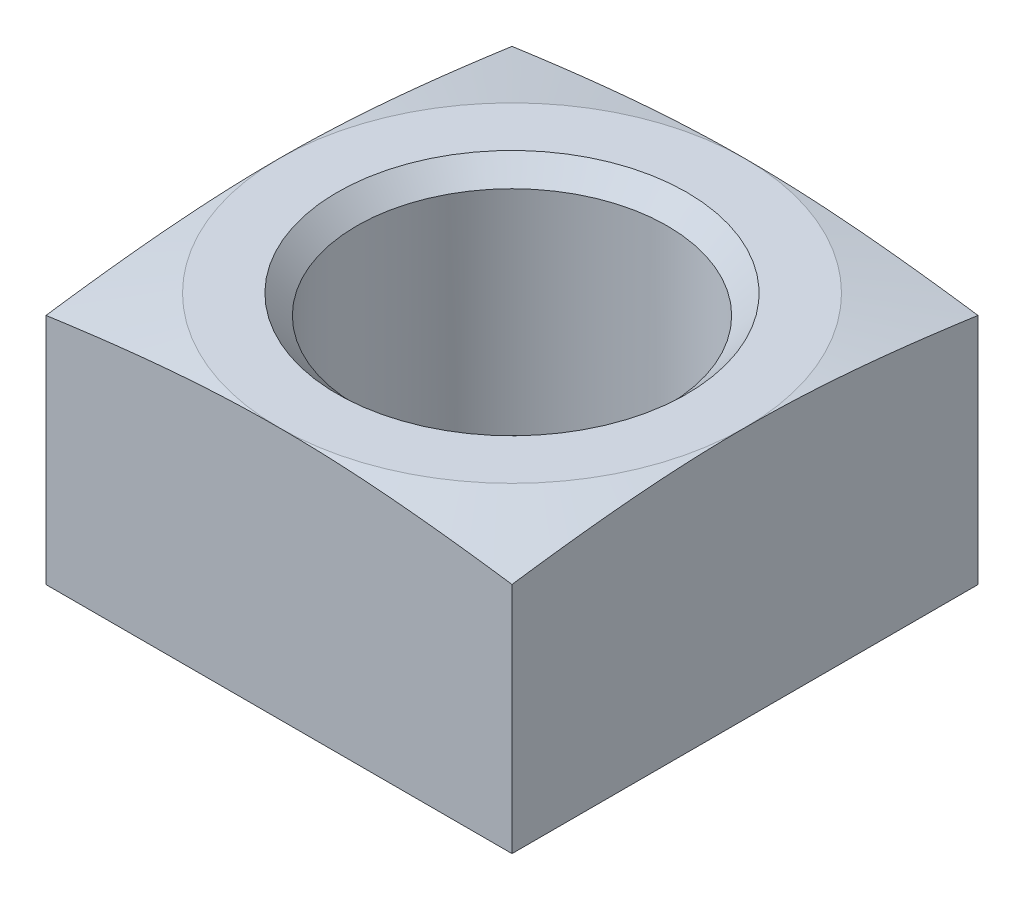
ISO-10303-21;
HEADER;
FILE_DESCRIPTION(('STEP AP214'),'2;1');
FILE_NAME('part.step','',(''),(''),'','','');
FILE_SCHEMA(('AUTOMOTIVE_DESIGN { 1 0 10303 214 1 1 1 1 }'));
ENDSEC;
DATA;
#1=APPLICATION_CONTEXT('core data for automotive mechanical design processes');
#2=APPLICATION_PROTOCOL_DEFINITION('international standard','automotive_design',2000,#1);
#3=PRODUCT_CONTEXT('',#1,'mechanical');
#4=PRODUCT('Part','Part','',(#3));
#5=PRODUCT_RELATED_PRODUCT_CATEGORY('part','',(#4));
#6=PRODUCT_DEFINITION_FORMATION('','',#4);
#7=PRODUCT_DEFINITION_CONTEXT('part definition',#1,'design');
#8=PRODUCT_DEFINITION('design','',#6,#7);
#9=PRODUCT_DEFINITION_SHAPE('','',#8);
#10=(LENGTH_UNIT() NAMED_UNIT(*) SI_UNIT(.MILLI.,.METRE.));
#11=(NAMED_UNIT(*) PLANE_ANGLE_UNIT() SI_UNIT($,.RADIAN.));
#12=(NAMED_UNIT(*) SI_UNIT($,.STERADIAN.) SOLID_ANGLE_UNIT());
#13=UNCERTAINTY_MEASURE_WITH_UNIT(LENGTH_MEASURE(1.E-05),#10,'distance_accuracy_value','');
#14=(GEOMETRIC_REPRESENTATION_CONTEXT(3) GLOBAL_UNCERTAINTY_ASSIGNED_CONTEXT((#13)) GLOBAL_UNIT_ASSIGNED_CONTEXT((#10,
#11,#12)) REPRESENTATION_CONTEXT('',''));
#15=CARTESIAN_POINT('',(0.,0.,0.));
#16=DIRECTION('',(0.,0.,1.));
#17=DIRECTION('',(1.,0.,0.));
#18=AXIS2_PLACEMENT_3D('',#15,#16,#17);
#19=CARTESIAN_POINT('',(12.,6.5,12.));
#20=DIRECTION('',(0.,0.,-1.));
#21=DIRECTION('',(-1.,0.,0.));
#22=AXIS2_PLACEMENT_3D('',#19,#20,#21);
#23=PLANE('',#22);
#24=DIRECTION('',(0.,-1.,0.));
#25=VECTOR('',#24,1.);
#26=CARTESIAN_POINT('',(12.,6.5,12.));
#27=LINE('',#26,#25);
#28=CARTESIAN_POINT('',(12.,5.50588745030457,12.));
#29=VERTEX_POINT('',#28);
#30=CARTESIAN_POINT('',(12.,-6.5,12.));
#31=VERTEX_POINT('',#30);
#32=EDGE_CURVE('E122',#29,#31,#27,.T.);
#33=ORIENTED_EDGE('',*,*,#32,.F.);
#34=CARTESIAN_POINT('',(-23.953590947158,3.54173714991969,12.));
#35=CARTESIAN_POINT('',(-23.3312218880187,3.65300849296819,12.));
#36=CARTESIAN_POINT('',(-22.7087066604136,3.76347087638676,12.));
#37=CARTESIAN_POINT('',(-21.4633093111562,3.98234194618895,12.));
#38=CARTESIAN_POINT('',(-20.8404271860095,4.09075061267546,12.));
#39=CARTESIAN_POINT('',(-19.594285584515,4.30506734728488,12.));
#40=CARTESIAN_POINT('',(-18.9710261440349,4.41097562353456,12.));
#41=CARTESIAN_POINT('',(-17.7239904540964,4.61970457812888,12.));
#42=CARTESIAN_POINT('',(-17.100214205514,4.72252526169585,12.));
#43=CARTESIAN_POINT('',(-15.8538299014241,4.92402388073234,12.));
#44=CARTESIAN_POINT('',(-15.2312236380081,5.0227128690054,12.));
#45=CARTESIAN_POINT('',(-13.9852621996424,5.21526876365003,12.));
#46=CARTESIAN_POINT('',(-13.3619070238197,5.30913566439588,12.));
#47=CARTESIAN_POINT('',(-12.1141151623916,5.49078517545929,12.));
#48=CARTESIAN_POINT('',(-11.4896782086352,5.57856595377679,12.));
#49=CARTESIAN_POINT('',(-10.2397502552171,5.74634930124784,12.));
#50=CARTESIAN_POINT('',(-9.61425925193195,5.82635184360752,12.));
#51=CARTESIAN_POINT('',(-8.35783107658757,5.97699569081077,12.));
#52=CARTESIAN_POINT('',(-7.72688575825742,6.04756975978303,12.));
#53=CARTESIAN_POINT('',(-6.46369871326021,6.17614944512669,12.));
#54=CARTESIAN_POINT('',(-5.83145698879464,6.23415508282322,12.));
#55=CARTESIAN_POINT('',(-4.56614823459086,6.33474486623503,12.));
#56=CARTESIAN_POINT('',(-3.93308203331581,6.37733924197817,12.));
#57=CARTESIAN_POINT('',(-2.66598623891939,6.44451772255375,12.));
#58=CARTESIAN_POINT('',(-2.03195666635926,6.46910220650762,12.));
#59=CARTESIAN_POINT('',(-0.762031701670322,6.49848071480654,12.));
#60=CARTESIAN_POINT('',(-0.126135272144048,6.50323110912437,12.));
#61=CARTESIAN_POINT('',(1.14548168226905,6.4924413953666,12.));
#62=CARTESIAN_POINT('',(1.78120220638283,6.47690119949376,12.));
#63=CARTESIAN_POINT('',(3.05226428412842,6.42672300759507,12.));
#64=CARTESIAN_POINT('',(3.68760537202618,6.39207340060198,12.));
#65=CARTESIAN_POINT('',(4.63973585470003,6.32754841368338,12.));
#66=CARTESIAN_POINT('',(4.95696877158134,6.30394804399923,12.));
#67=CARTESIAN_POINT('',(5.59112625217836,6.25291431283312,12.));
#68=CARTESIAN_POINT('',(5.90805081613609,6.22548095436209,12.));
#69=CARTESIAN_POINT('',(7.12743714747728,6.11319192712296,12.));
#70=CARTESIAN_POINT('',(8.02876829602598,6.01597313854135,12.));
#71=CARTESIAN_POINT('',(9.82900087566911,5.8010512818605,12.));
#72=CARTESIAN_POINT('',(10.7279020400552,5.68334605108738,12.));
#73=CARTESIAN_POINT('',(12.5239827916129,5.43339082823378,12.));
#74=CARTESIAN_POINT('',(13.4211616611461,5.30113572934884,12.));
#75=CARTESIAN_POINT('',(15.2138906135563,5.02633800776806,12.));
#76=CARTESIAN_POINT('',(16.1094407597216,4.88379579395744,12.));
#77=CARTESIAN_POINT('',(17.9004767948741,4.59112284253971,12.));
#78=CARTESIAN_POINT('',(18.7959611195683,4.4409825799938,12.));
#79=CARTESIAN_POINT('',(20.5860048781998,4.13526710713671,12.));
#80=CARTESIAN_POINT('',(21.4805643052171,3.97969185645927,12.));
#81=CARTESIAN_POINT('',(23.2687784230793,3.66451437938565,12.));
#82=CARTESIAN_POINT('',(24.1624332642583,3.50491300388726,12.));
#83=CARTESIAN_POINT('',(25.9491817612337,3.18261839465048,12.));
#84=CARTESIAN_POINT('',(26.8422754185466,3.01992516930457,12.));
#85=CARTESIAN_POINT('',(28.6247643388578,2.69273848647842,12.));
#86=CARTESIAN_POINT('',(29.5141612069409,2.52825376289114,12.));
#87=CARTESIAN_POINT('',(31.2926047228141,2.19740069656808,12.));
#88=CARTESIAN_POINT('',(32.1816513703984,2.03103235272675,12.));
#89=CARTESIAN_POINT('',(34.8484835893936,1.52966341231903,12.));
#90=CARTESIAN_POINT('',(36.6258473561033,1.19241995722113,12.));
#91=CARTESIAN_POINT('',(40.1749325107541,0.514898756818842,12.));
#92=CARTESIAN_POINT('',(41.9466559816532,0.174631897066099,12.));
#93=CARTESIAN_POINT('',(44.6037760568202,-0.337840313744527,12.));
#94=CARTESIAN_POINT('',(45.4893738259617,-0.50900359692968,12.));
#95=CARTESIAN_POINT('',(47.2604536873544,-0.851925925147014,12.));
#96=CARTESIAN_POINT('',(48.1459357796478,-1.02368496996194,12.));
#97=CARTESIAN_POINT('',(49.0313695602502,-1.1956925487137,12.));
#98=B_SPLINE_CURVE_WITH_KNOTS('',3,(#34,#35,#36,#37,#38,#39,#40,#41,#42,#43,#44,#45,#46,#47,#48,
#49,#50,#51,#52,#53,#54,#55,#56,#57,#58,#59,#60,#61,#62,#63,#64,#65,#66,#67,#68,#69,#70,#71,#72,
#73,#74,#75,#76,#77,#78,#79,#80,#81,#82,#83,#84,#85,#86,#87,#88,#89,#90,#91,#92,#93,#94,#95,#96,
#97),.UNSPECIFIED.,.F.,.F.,(4,2,2,2,2,2,2,2,2,2,2,2,2,2,2,2,2,2,2,2,2,2,2,2,2,2,2,2,2,2,2,4),
(0.,1.89671494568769,3.79344825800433,5.69002312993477,7.58659479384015,9.47771793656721,
11.3688432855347,13.2605354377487,15.1522341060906,17.0567746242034,18.961311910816,
20.8645826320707,22.7678132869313,24.6752283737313,26.5826517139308,28.4912352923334,
29.4455448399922,30.3998536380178,33.1191461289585,35.8387258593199,38.5592631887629,
41.2796924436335,44.0036208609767,46.7275695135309,49.4509472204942,52.1743175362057,
54.8877515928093,57.6011872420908,63.028406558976,68.4407111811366,71.1466715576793,
73.8526309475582),.UNSPECIFIED.);
#99=CARTESIAN_POINT('',(0.,6.5,12.));
#100=VERTEX_POINT('',#99);
#101=EDGE_CURVE('E99',#29,#100,#98,.F.);
#102=ORIENTED_EDGE('',*,*,#101,.T.);
#103=CARTESIAN_POINT('',(-12.,5.50588745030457,12.));
#104=VERTEX_POINT('',#103);
#105=EDGE_CURVE('E112',#100,#104,#98,.F.);
#106=ORIENTED_EDGE('',*,*,#105,.T.);
#107=DIRECTION('',(0.,-1.,0.));
#108=VECTOR('',#107,1.);
#109=CARTESIAN_POINT('',(-12.,6.5,12.));
#110=LINE('',#109,#108);
#111=CARTESIAN_POINT('',(-12.,-6.5,12.));
#112=VERTEX_POINT('',#111);
#113=EDGE_CURVE('E184',#104,#112,#110,.T.);
#114=ORIENTED_EDGE('',*,*,#113,.T.);
#115=DIRECTION('',(-1.,0.,0.));
#116=VECTOR('',#115,1.);
#117=CARTESIAN_POINT('',(12.,-6.5,12.));
#118=LINE('',#117,#116);
#119=EDGE_CURVE('E194',#31,#112,#118,.T.);
#120=ORIENTED_EDGE('',*,*,#119,.F.);
#121=EDGE_LOOP('',(#33,#102,#106,#114,#120));
#122=FACE_BOUND('',#121,.T.);
#123=ADVANCED_FACE('F39',(#122),#23,.F.);
#124=CARTESIAN_POINT('',(12.,-6.5,-12.));
#125=DIRECTION('',(0.,1.,0.));
#126=DIRECTION('',(0.,0.,1.));
#127=AXIS2_PLACEMENT_3D('',#124,#125,#126);
#128=PLANE('',#127);
#129=CARTESIAN_POINT('',(0.,-6.5,0.));
#130=DIRECTION('',(0.,1.,0.));
#131=DIRECTION('',(0.,0.,1.));
#132=AXIS2_PLACEMENT_3D('',#129,#130,#131);
#133=CIRCLE('',#132,9.00000000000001);
#134=CARTESIAN_POINT('',(0.,-6.5,9.));
#135=VERTEX_POINT('',#134);
#136=EDGE_CURVE('E11',#135,#135,#133,.T.);
#137=ORIENTED_EDGE('',*,*,#136,.T.);
#138=EDGE_LOOP('',(#137));
#139=FACE_BOUND('',#138,.T.);
#140=DIRECTION('',(0.,0.,-1.));
#141=VECTOR('',#140,1.);
#142=CARTESIAN_POINT('',(-12.,-6.5,-12.));
#143=LINE('',#142,#141);
#144=CARTESIAN_POINT('',(-12.,-6.5,-12.));
#145=VERTEX_POINT('',#144);
#146=EDGE_CURVE('E187',#112,#145,#143,.T.);
#147=ORIENTED_EDGE('',*,*,#146,.T.);
#148=DIRECTION('',(-1.,0.,0.));
#149=VECTOR('',#148,1.);
#150=CARTESIAN_POINT('',(12.,-6.5,-12.));
#151=LINE('',#150,#149);
#152=CARTESIAN_POINT('',(12.,-6.5,-12.));
#153=VERTEX_POINT('',#152);
#154=EDGE_CURVE('E183',#153,#145,#151,.T.);
#155=ORIENTED_EDGE('',*,*,#154,.F.);
#156=DIRECTION('',(0.,0.,-1.));
#157=VECTOR('',#156,1.);
#158=CARTESIAN_POINT('',(12.,-6.5,-12.));
#159=LINE('',#158,#157);
#160=EDGE_CURVE('E175',#31,#153,#159,.T.);
#161=ORIENTED_EDGE('',*,*,#160,.F.);
#162=ORIENTED_EDGE('',*,*,#119,.T.);
#163=EDGE_LOOP('',(#147,#155,#161,#162));
#164=FACE_BOUND('',#163,.T.);
#165=ADVANCED_FACE('F226',(#139,#164),#128,.F.);
#166=CARTESIAN_POINT('',(12.,6.5,-12.));
#167=DIRECTION('',(0.,0.,1.));
#168=DIRECTION('',(0.,-1.,0.));
#169=AXIS2_PLACEMENT_3D('',#166,#167,#168);
#170=PLANE('',#169);
#171=DIRECTION('',(0.,1.,0.));
#172=VECTOR('',#171,1.);
#173=CARTESIAN_POINT('',(-12.,6.5,-12.));
#174=LINE('',#173,#172);
#175=CARTESIAN_POINT('',(-12.,5.50588745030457,-12.));
#176=VERTEX_POINT('',#175);
#177=EDGE_CURVE('E176',#145,#176,#174,.T.);
#178=ORIENTED_EDGE('',*,*,#177,.T.);
#179=CARTESIAN_POINT('',(-23.953590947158,3.54173714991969,-12.));
#180=CARTESIAN_POINT('',(-23.3312218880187,3.65300849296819,-12.));
#181=CARTESIAN_POINT('',(-22.7087066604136,3.76347087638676,-12.));
#182=CARTESIAN_POINT('',(-21.4633093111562,3.98234194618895,-12.));
#183=CARTESIAN_POINT('',(-20.8404271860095,4.09075061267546,-12.));
#184=CARTESIAN_POINT('',(-19.594285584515,4.30506734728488,-12.));
#185=CARTESIAN_POINT('',(-18.9710261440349,4.41097562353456,-12.));
#186=CARTESIAN_POINT('',(-17.7239904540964,4.61970457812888,-12.));
#187=CARTESIAN_POINT('',(-17.100214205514,4.72252526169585,-12.));
#188=CARTESIAN_POINT('',(-15.8538299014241,4.92402388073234,-12.));
#189=CARTESIAN_POINT('',(-15.2312236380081,5.0227128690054,-12.));
#190=CARTESIAN_POINT('',(-13.9852621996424,5.21526876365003,-12.));
#191=CARTESIAN_POINT('',(-13.3619070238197,5.30913566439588,-12.));
#192=CARTESIAN_POINT('',(-12.1141151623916,5.49078517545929,-12.));
#193=CARTESIAN_POINT('',(-11.4896782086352,5.57856595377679,-12.));
#194=CARTESIAN_POINT('',(-10.2397502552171,5.74634930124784,-12.));
#195=CARTESIAN_POINT('',(-9.61425925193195,5.82635184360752,-12.));
#196=CARTESIAN_POINT('',(-8.35783107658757,5.97699569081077,-12.));
#197=CARTESIAN_POINT('',(-7.72688575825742,6.04756975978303,-12.));
#198=CARTESIAN_POINT('',(-6.46369871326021,6.17614944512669,-12.));
#199=CARTESIAN_POINT('',(-5.83145698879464,6.23415508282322,-12.));
#200=CARTESIAN_POINT('',(-4.56614823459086,6.33474486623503,-12.));
#201=CARTESIAN_POINT('',(-3.93308203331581,6.37733924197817,-12.));
#202=CARTESIAN_POINT('',(-2.66598623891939,6.44451772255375,-12.));
#203=CARTESIAN_POINT('',(-2.03195666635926,6.46910220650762,-12.));
#204=CARTESIAN_POINT('',(-0.762031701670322,6.49848071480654,-12.));
#205=CARTESIAN_POINT('',(-0.126135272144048,6.50323110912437,-12.));
#206=CARTESIAN_POINT('',(1.14548168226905,6.4924413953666,-12.));
#207=CARTESIAN_POINT('',(1.78120220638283,6.47690119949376,-12.));
#208=CARTESIAN_POINT('',(3.05226428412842,6.42672300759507,-12.));
#209=CARTESIAN_POINT('',(3.68760537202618,6.39207340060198,-12.));
#210=CARTESIAN_POINT('',(4.63973585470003,6.32754841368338,-12.));
#211=CARTESIAN_POINT('',(4.95696877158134,6.30394804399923,-12.));
#212=CARTESIAN_POINT('',(5.59112625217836,6.25291431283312,-12.));
#213=CARTESIAN_POINT('',(5.90805081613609,6.22548095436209,-12.));
#214=CARTESIAN_POINT('',(7.12743714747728,6.11319192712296,-12.));
#215=CARTESIAN_POINT('',(8.02876829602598,6.01597313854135,-12.));
#216=CARTESIAN_POINT('',(9.82900087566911,5.8010512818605,-12.));
#217=CARTESIAN_POINT('',(10.7279020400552,5.68334605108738,-12.));
#218=CARTESIAN_POINT('',(12.5239827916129,5.43339082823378,-12.));
#219=CARTESIAN_POINT('',(13.4211616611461,5.30113572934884,-12.));
#220=CARTESIAN_POINT('',(15.2138906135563,5.02633800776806,-12.));
#221=CARTESIAN_POINT('',(16.1094407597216,4.88379579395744,-12.));
#222=CARTESIAN_POINT('',(17.9004767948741,4.59112284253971,-12.));
#223=CARTESIAN_POINT('',(18.7959611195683,4.4409825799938,-12.));
#224=CARTESIAN_POINT('',(20.5860048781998,4.13526710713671,-12.));
#225=CARTESIAN_POINT('',(21.4805643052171,3.97969185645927,-12.));
#226=CARTESIAN_POINT('',(23.2687784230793,3.66451437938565,-12.));
#227=CARTESIAN_POINT('',(24.1624332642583,3.50491300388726,-12.));
#228=CARTESIAN_POINT('',(25.9491817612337,3.18261839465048,-12.));
#229=CARTESIAN_POINT('',(26.8422754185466,3.01992516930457,-12.));
#230=CARTESIAN_POINT('',(28.6247643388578,2.69273848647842,-12.));
#231=CARTESIAN_POINT('',(29.5141612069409,2.52825376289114,-12.));
#232=CARTESIAN_POINT('',(31.2926047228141,2.19740069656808,-12.));
#233=CARTESIAN_POINT('',(32.1816513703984,2.03103235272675,-12.));
#234=CARTESIAN_POINT('',(34.8484835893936,1.52966341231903,-12.));
#235=CARTESIAN_POINT('',(36.6258473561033,1.19241995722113,-12.));
#236=CARTESIAN_POINT('',(40.1749325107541,0.514898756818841,-12.));
#237=CARTESIAN_POINT('',(41.9466559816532,0.174631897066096,-12.));
#238=CARTESIAN_POINT('',(44.6037760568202,-0.337840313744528,-12.));
#239=CARTESIAN_POINT('',(45.4893738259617,-0.509003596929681,-12.));
#240=CARTESIAN_POINT('',(47.2604536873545,-0.851925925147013,-12.));
#241=CARTESIAN_POINT('',(48.1459357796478,-1.02368496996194,-12.));
#242=CARTESIAN_POINT('',(49.0313695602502,-1.1956925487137,-12.));
#243=B_SPLINE_CURVE_WITH_KNOTS('',3,(#179,#180,#181,#182,#183,#184,#185,#186,#187,#188,#189,
#190,#191,#192,#193,#194,#195,#196,#197,#198,#199,#200,#201,#202,#203,#204,#205,#206,#207,#208,
#209,#210,#211,#212,#213,#214,#215,#216,#217,#218,#219,#220,#221,#222,#223,#224,#225,#226,#227,
#228,#229,#230,#231,#232,#233,#234,#235,#236,#237,#238,#239,#240,#241,#242),.UNSPECIFIED.,.F.,
.F.,(4,2,2,2,2,2,2,2,2,2,2,2,2,2,2,2,2,2,2,2,2,2,2,2,2,2,2,2,2,2,2,4),(0.,1.89671494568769,
3.79344825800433,5.69002312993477,7.58659479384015,9.47771793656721,11.3688432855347,
13.2605354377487,15.1522341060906,17.0567746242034,18.961311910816,20.8645826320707,
22.7678132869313,24.6752283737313,26.5826517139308,28.4912352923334,29.4455448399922,
30.3998536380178,33.1191461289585,35.8387258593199,38.5592631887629,41.2796924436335,
44.0036208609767,46.7275695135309,49.4509472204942,52.1743175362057,54.8877515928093,
57.6011872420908,63.028406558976,68.4407111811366,71.1466715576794,73.8526309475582),.UNSPECIFIED.);
#244=CARTESIAN_POINT('',(0.,6.5,-12.));
#245=VERTEX_POINT('',#244);
#246=EDGE_CURVE('E62',#176,#245,#243,.T.);
#247=ORIENTED_EDGE('',*,*,#246,.T.);
#248=CARTESIAN_POINT('',(12.,5.50588745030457,-12.));
#249=VERTEX_POINT('',#248);
#250=EDGE_CURVE('E138',#245,#249,#243,.T.);
#251=ORIENTED_EDGE('',*,*,#250,.T.);
#252=DIRECTION('',(0.,1.,0.));
#253=VECTOR('',#252,1.);
#254=CARTESIAN_POINT('',(12.,6.5,-12.));
#255=LINE('',#254,#253);
#256=EDGE_CURVE('E179',#153,#249,#255,.T.);
#257=ORIENTED_EDGE('',*,*,#256,.F.);
#258=ORIENTED_EDGE('',*,*,#154,.T.);
#259=EDGE_LOOP('',(#178,#247,#251,#257,#258));
#260=FACE_BOUND('',#259,.T.);
#261=ADVANCED_FACE('F144',(#260),#170,.F.);
#262=CARTESIAN_POINT('',(12.,0.,0.));
#263=DIRECTION('',(-1.,0.,0.));
#264=DIRECTION('',(0.,0.,1.));
#265=AXIS2_PLACEMENT_3D('',#262,#263,#264);
#266=PLANE('',#265);
#267=ORIENTED_EDGE('',*,*,#256,.T.);
#268=CARTESIAN_POINT('',(12.,3.54173714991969,-23.953590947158));
#269=CARTESIAN_POINT('',(12.,3.65300849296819,-23.3312218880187));
#270=CARTESIAN_POINT('',(12.,3.76347087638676,-22.7087066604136));
#271=CARTESIAN_POINT('',(12.,3.98234194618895,-21.4633093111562));
#272=CARTESIAN_POINT('',(12.,4.09075061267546,-20.8404271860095));
#273=CARTESIAN_POINT('',(12.,4.30506734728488,-19.594285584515));
#274=CARTESIAN_POINT('',(12.,4.41097562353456,-18.9710261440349));
#275=CARTESIAN_POINT('',(12.,4.61970457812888,-17.7239904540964));
#276=CARTESIAN_POINT('',(12.,4.72252526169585,-17.100214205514));
#277=CARTESIAN_POINT('',(12.,4.92402388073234,-15.8538299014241));
#278=CARTESIAN_POINT('',(12.,5.0227128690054,-15.2312236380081));
#279=CARTESIAN_POINT('',(12.,5.21526876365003,-13.9852621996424));
#280=CARTESIAN_POINT('',(12.,5.30913566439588,-13.3619070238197));
#281=CARTESIAN_POINT('',(12.,5.49078517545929,-12.1141151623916));
#282=CARTESIAN_POINT('',(12.,5.57856595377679,-11.4896782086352));
#283=CARTESIAN_POINT('',(12.,5.74634930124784,-10.2397502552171));
#284=CARTESIAN_POINT('',(12.,5.82635184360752,-9.61425925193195));
#285=CARTESIAN_POINT('',(12.,5.97699569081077,-8.35783107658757));
#286=CARTESIAN_POINT('',(12.,6.04756975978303,-7.72688575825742));
#287=CARTESIAN_POINT('',(12.,6.17614944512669,-6.46369871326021));
#288=CARTESIAN_POINT('',(12.,6.23415508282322,-5.83145698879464));
#289=CARTESIAN_POINT('',(12.,6.33474486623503,-4.56614823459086));
#290=CARTESIAN_POINT('',(12.,6.37733924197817,-3.93308203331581));
#291=CARTESIAN_POINT('',(12.,6.44451772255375,-2.66598623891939));
#292=CARTESIAN_POINT('',(12.,6.46910220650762,-2.03195666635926));
#293=CARTESIAN_POINT('',(12.,6.49848071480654,-0.762031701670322));
#294=CARTESIAN_POINT('',(12.,6.50323110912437,-0.126135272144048));
#295=CARTESIAN_POINT('',(12.,6.4924413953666,1.14548168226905));
#296=CARTESIAN_POINT('',(12.,6.47690119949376,1.78120220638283));
#297=CARTESIAN_POINT('',(12.,6.42672300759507,3.05226428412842));
#298=CARTESIAN_POINT('',(12.,6.39207340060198,3.68760537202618));
#299=CARTESIAN_POINT('',(12.,6.32754841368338,4.63973585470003));
#300=CARTESIAN_POINT('',(12.,6.30394804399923,4.95696877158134));
#301=CARTESIAN_POINT('',(12.,6.25291431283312,5.59112625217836));
#302=CARTESIAN_POINT('',(12.,6.22548095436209,5.90805081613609));
#303=CARTESIAN_POINT('',(12.,6.11319192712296,7.12743714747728));
#304=CARTESIAN_POINT('',(12.,6.01597313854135,8.02876829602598));
#305=CARTESIAN_POINT('',(12.,5.8010512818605,9.82900087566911));
#306=CARTESIAN_POINT('',(12.,5.68334605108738,10.7279020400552));
#307=CARTESIAN_POINT('',(12.,5.43339082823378,12.5239827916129));
#308=CARTESIAN_POINT('',(12.,5.30113572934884,13.4211616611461));
#309=CARTESIAN_POINT('',(12.,5.02633800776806,15.2138906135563));
#310=CARTESIAN_POINT('',(12.,4.88379579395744,16.1094407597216));
#311=CARTESIAN_POINT('',(12.,4.59112284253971,17.9004767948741));
#312=CARTESIAN_POINT('',(12.,4.4409825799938,18.7959611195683));
#313=CARTESIAN_POINT('',(12.,4.13526710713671,20.5860048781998));
#314=CARTESIAN_POINT('',(12.,3.97969185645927,21.4805643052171));
#315=CARTESIAN_POINT('',(12.,3.66451437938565,23.2687784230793));
#316=CARTESIAN_POINT('',(12.,3.50491300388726,24.1624332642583));
#317=CARTESIAN_POINT('',(12.,3.18261839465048,25.9491817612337));
#318=CARTESIAN_POINT('',(12.,3.01992516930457,26.8422754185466));
#319=CARTESIAN_POINT('',(12.,2.69273848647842,28.6247643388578));
#320=CARTESIAN_POINT('',(12.,2.52825376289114,29.5141612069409));
#321=CARTESIAN_POINT('',(12.,2.19740069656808,31.2926047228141));
#322=CARTESIAN_POINT('',(12.,2.03103235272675,32.1816513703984));
#323=CARTESIAN_POINT('',(12.,1.52966341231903,34.8484835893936));
#324=CARTESIAN_POINT('',(12.,1.19241995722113,36.6258473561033));
#325=CARTESIAN_POINT('',(12.,0.514898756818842,40.1749325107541));
#326=CARTESIAN_POINT('',(12.,0.174631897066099,41.9466559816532));
#327=CARTESIAN_POINT('',(12.,-0.337840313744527,44.6037760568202));
#328=CARTESIAN_POINT('',(12.,-0.50900359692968,45.4893738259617));
#329=CARTESIAN_POINT('',(12.,-0.851925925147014,47.2604536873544));
#330=CARTESIAN_POINT('',(12.,-1.02368496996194,48.1459357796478));
#331=CARTESIAN_POINT('',(12.,-1.1956925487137,49.0313695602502));
#332=B_SPLINE_CURVE_WITH_KNOTS('',3,(#268,#269,#270,#271,#272,#273,#274,#275,#276,#277,#278,
#279,#280,#281,#282,#283,#284,#285,#286,#287,#288,#289,#290,#291,#292,#293,#294,#295,#296,#297,
#298,#299,#300,#301,#302,#303,#304,#305,#306,#307,#308,#309,#310,#311,#312,#313,#314,#315,#316,
#317,#318,#319,#320,#321,#322,#323,#324,#325,#326,#327,#328,#329,#330,#331),.UNSPECIFIED.,.F.,
.F.,(4,2,2,2,2,2,2,2,2,2,2,2,2,2,2,2,2,2,2,2,2,2,2,2,2,2,2,2,2,2,2,4),(0.,1.89671494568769,
3.79344825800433,5.69002312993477,7.58659479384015,9.47771793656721,11.3688432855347,
13.2605354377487,15.1522341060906,17.0567746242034,18.961311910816,20.8645826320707,
22.7678132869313,24.6752283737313,26.5826517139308,28.4912352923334,29.4455448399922,
30.3998536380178,33.1191461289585,35.8387258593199,38.5592631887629,41.2796924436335,
44.0036208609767,46.7275695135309,49.4509472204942,52.1743175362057,54.8877515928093,
57.6011872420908,63.028406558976,68.4407111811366,71.1466715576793,73.8526309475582),.UNSPECIFIED.);
#333=CARTESIAN_POINT('',(12.,6.5,0.));
#334=VERTEX_POINT('',#333);
#335=EDGE_CURVE('E172',#249,#334,#332,.T.);
#336=ORIENTED_EDGE('',*,*,#335,.T.);
#337=EDGE_CURVE('E101',#334,#29,#332,.T.);
#338=ORIENTED_EDGE('',*,*,#337,.T.);
#339=ORIENTED_EDGE('',*,*,#32,.T.);
#340=ORIENTED_EDGE('',*,*,#160,.T.);
#341=EDGE_LOOP('',(#267,#336,#338,#339,#340));
#342=FACE_BOUND('',#341,.T.);
#343=ADVANCED_FACE('F156',(#342),#266,.F.);
#344=CARTESIAN_POINT('',(-12.,0.,0.));
#345=DIRECTION('',(-1.,0.,0.));
#346=DIRECTION('',(0.,0.,1.));
#347=AXIS2_PLACEMENT_3D('',#344,#345,#346);
#348=PLANE('',#347);
#349=CARTESIAN_POINT('',(-12.,3.54173714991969,-23.953590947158));
#350=CARTESIAN_POINT('',(-12.,3.65300849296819,-23.3312218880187));
#351=CARTESIAN_POINT('',(-12.,3.76347087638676,-22.7087066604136));
#352=CARTESIAN_POINT('',(-12.,3.98234194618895,-21.4633093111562));
#353=CARTESIAN_POINT('',(-12.,4.09075061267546,-20.8404271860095));
#354=CARTESIAN_POINT('',(-12.,4.30506734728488,-19.594285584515));
#355=CARTESIAN_POINT('',(-12.,4.41097562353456,-18.9710261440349));
#356=CARTESIAN_POINT('',(-12.,4.61970457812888,-17.7239904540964));
#357=CARTESIAN_POINT('',(-12.,4.72252526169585,-17.100214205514));
#358=CARTESIAN_POINT('',(-12.,4.92402388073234,-15.8538299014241));
#359=CARTESIAN_POINT('',(-12.,5.0227128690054,-15.2312236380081));
#360=CARTESIAN_POINT('',(-12.,5.21526876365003,-13.9852621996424));
#361=CARTESIAN_POINT('',(-12.,5.30913566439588,-13.3619070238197));
#362=CARTESIAN_POINT('',(-12.,5.49078517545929,-12.1141151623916));
#363=CARTESIAN_POINT('',(-12.,5.57856595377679,-11.4896782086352));
#364=CARTESIAN_POINT('',(-12.,5.74634930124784,-10.2397502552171));
#365=CARTESIAN_POINT('',(-12.,5.82635184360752,-9.61425925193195));
#366=CARTESIAN_POINT('',(-12.,5.97699569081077,-8.35783107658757));
#367=CARTESIAN_POINT('',(-12.,6.04756975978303,-7.72688575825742));
#368=CARTESIAN_POINT('',(-12.,6.17614944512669,-6.46369871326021));
#369=CARTESIAN_POINT('',(-12.,6.23415508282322,-5.83145698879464));
#370=CARTESIAN_POINT('',(-12.,6.33474486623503,-4.56614823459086));
#371=CARTESIAN_POINT('',(-12.,6.37733924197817,-3.93308203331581));
#372=CARTESIAN_POINT('',(-12.,6.44451772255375,-2.66598623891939));
#373=CARTESIAN_POINT('',(-12.,6.46910220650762,-2.03195666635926));
#374=CARTESIAN_POINT('',(-12.,6.49848071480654,-0.762031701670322));
#375=CARTESIAN_POINT('',(-12.,6.50323110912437,-0.126135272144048));
#376=CARTESIAN_POINT('',(-12.,6.4924413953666,1.14548168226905));
#377=CARTESIAN_POINT('',(-12.,6.47690119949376,1.78120220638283));
#378=CARTESIAN_POINT('',(-12.,6.42672300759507,3.05226428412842));
#379=CARTESIAN_POINT('',(-12.,6.39207340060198,3.68760537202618));
#380=CARTESIAN_POINT('',(-12.,6.32754841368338,4.63973585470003));
#381=CARTESIAN_POINT('',(-12.,6.30394804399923,4.95696877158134));
#382=CARTESIAN_POINT('',(-12.,6.25291431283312,5.59112625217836));
#383=CARTESIAN_POINT('',(-12.,6.22548095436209,5.90805081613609));
#384=CARTESIAN_POINT('',(-12.,6.11319192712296,7.12743714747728));
#385=CARTESIAN_POINT('',(-12.,6.01597313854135,8.02876829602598));
#386=CARTESIAN_POINT('',(-12.,5.8010512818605,9.82900087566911));
#387=CARTESIAN_POINT('',(-12.,5.68334605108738,10.7279020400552));
#388=CARTESIAN_POINT('',(-12.,5.43339082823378,12.5239827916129));
#389=CARTESIAN_POINT('',(-12.,5.30113572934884,13.4211616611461));
#390=CARTESIAN_POINT('',(-12.,5.02633800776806,15.2138906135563));
#391=CARTESIAN_POINT('',(-12.,4.88379579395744,16.1094407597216));
#392=CARTESIAN_POINT('',(-12.,4.59112284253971,17.9004767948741));
#393=CARTESIAN_POINT('',(-12.,4.4409825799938,18.7959611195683));
#394=CARTESIAN_POINT('',(-12.,4.13526710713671,20.5860048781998));
#395=CARTESIAN_POINT('',(-12.,3.97969185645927,21.4805643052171));
#396=CARTESIAN_POINT('',(-12.,3.66451437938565,23.2687784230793));
#397=CARTESIAN_POINT('',(-12.,3.50491300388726,24.1624332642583));
#398=CARTESIAN_POINT('',(-12.,3.18261839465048,25.9491817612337));
#399=CARTESIAN_POINT('',(-12.,3.01992516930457,26.8422754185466));
#400=CARTESIAN_POINT('',(-12.,2.69273848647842,28.6247643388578));
#401=CARTESIAN_POINT('',(-12.,2.52825376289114,29.5141612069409));
#402=CARTESIAN_POINT('',(-12.,2.19740069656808,31.2926047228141));
#403=CARTESIAN_POINT('',(-12.,2.03103235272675,32.1816513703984));
#404=CARTESIAN_POINT('',(-12.,1.52966341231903,34.8484835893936));
#405=CARTESIAN_POINT('',(-12.,1.19241995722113,36.6258473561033));
#406=CARTESIAN_POINT('',(-12.,0.514898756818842,40.1749325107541));
#407=CARTESIAN_POINT('',(-12.,0.174631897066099,41.9466559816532));
#408=CARTESIAN_POINT('',(-12.,-0.337840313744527,44.6037760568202));
#409=CARTESIAN_POINT('',(-12.,-0.50900359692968,45.4893738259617));
#410=CARTESIAN_POINT('',(-12.,-0.851925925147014,47.2604536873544));
#411=CARTESIAN_POINT('',(-12.,-1.02368496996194,48.1459357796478));
#412=CARTESIAN_POINT('',(-12.,-1.1956925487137,49.0313695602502));
#413=B_SPLINE_CURVE_WITH_KNOTS('',3,(#349,#350,#351,#352,#353,#354,#355,#356,#357,#358,#359,
#360,#361,#362,#363,#364,#365,#366,#367,#368,#369,#370,#371,#372,#373,#374,#375,#376,#377,#378,
#379,#380,#381,#382,#383,#384,#385,#386,#387,#388,#389,#390,#391,#392,#393,#394,#395,#396,#397,
#398,#399,#400,#401,#402,#403,#404,#405,#406,#407,#408,#409,#410,#411,#412),.UNSPECIFIED.,.F.,
.F.,(4,2,2,2,2,2,2,2,2,2,2,2,2,2,2,2,2,2,2,2,2,2,2,2,2,2,2,2,2,2,2,4),(0.,1.89671494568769,
3.79344825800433,5.69002312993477,7.58659479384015,9.47771793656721,11.3688432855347,
13.2605354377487,15.1522341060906,17.0567746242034,18.961311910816,20.8645826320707,
22.7678132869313,24.6752283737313,26.5826517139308,28.4912352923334,29.4455448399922,
30.3998536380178,33.1191461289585,35.8387258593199,38.5592631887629,41.2796924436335,
44.0036208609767,46.7275695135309,49.4509472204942,52.1743175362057,54.8877515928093,
57.6011872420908,63.028406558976,68.4407111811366,71.1466715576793,73.8526309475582),.UNSPECIFIED.);
#414=CARTESIAN_POINT('',(-12.,6.5,0.));
#415=VERTEX_POINT('',#414);
#416=EDGE_CURVE('E55',#176,#415,#413,.T.);
#417=ORIENTED_EDGE('',*,*,#416,.F.);
#418=ORIENTED_EDGE('',*,*,#177,.F.);
#419=ORIENTED_EDGE('',*,*,#146,.F.);
#420=ORIENTED_EDGE('',*,*,#113,.F.);
#421=EDGE_CURVE('E115',#415,#104,#413,.T.);
#422=ORIENTED_EDGE('',*,*,#421,.F.);
#423=EDGE_LOOP('',(#417,#418,#419,#420,#422));
#424=FACE_BOUND('',#423,.T.);
#425=ADVANCED_FACE('F241',(#424),#348,.T.);
#426=CARTESIAN_POINT('',(0.,5.5,0.));
#427=DIRECTION('',(0.,-1.,0.));
#428=DIRECTION('',(0.,0.,-1.));
#429=AXIS2_PLACEMENT_3D('',#426,#427,#428);
#430=CONICAL_SURFACE('',#429,17.,1.37340076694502);
#431=CARTESIAN_POINT('',(0.,6.5,0.));
#432=DIRECTION('',(0.,1.,0.));
#433=DIRECTION('',(0.,0.,1.));
#434=AXIS2_PLACEMENT_3D('',#431,#432,#433);
#435=CIRCLE('',#434,12.);
#436=EDGE_CURVE('E109',#415,#100,#435,.T.);
#437=ORIENTED_EDGE('',*,*,#436,.F.);
#438=ORIENTED_EDGE('',*,*,#421,.T.);
#439=ORIENTED_EDGE('',*,*,#105,.F.);
#440=EDGE_LOOP('',(#437,#438,#439));
#441=FACE_BOUND('',#440,.T.);
#442=ADVANCED_FACE('F113',(#441),#430,.T.);
#443=ORIENTED_EDGE('',*,*,#416,.T.);
#444=EDGE_CURVE('E126',#245,#415,#435,.T.);
#445=ORIENTED_EDGE('',*,*,#444,.F.);
#446=ORIENTED_EDGE('',*,*,#246,.F.);
#447=EDGE_LOOP('',(#443,#445,#446));
#448=FACE_BOUND('',#447,.T.);
#449=ADVANCED_FACE('F154',(#448),#430,.T.);
#450=EDGE_CURVE('E95',#100,#334,#435,.T.);
#451=ORIENTED_EDGE('',*,*,#450,.F.);
#452=ORIENTED_EDGE('',*,*,#101,.F.);
#453=ORIENTED_EDGE('',*,*,#337,.F.);
#454=EDGE_LOOP('',(#451,#452,#453));
#455=FACE_BOUND('',#454,.T.);
#456=ADVANCED_FACE('F97',(#455),#430,.T.);
#457=EDGE_CURVE('E107',#334,#245,#435,.T.);
#458=ORIENTED_EDGE('',*,*,#457,.F.);
#459=ORIENTED_EDGE('',*,*,#335,.F.);
#460=ORIENTED_EDGE('',*,*,#250,.F.);
#461=EDGE_LOOP('',(#458,#459,#460));
#462=FACE_BOUND('',#461,.T.);
#463=ADVANCED_FACE('F148',(#462),#430,.T.);
#464=CARTESIAN_POINT('',(12.,6.5,-12.));
#465=DIRECTION('',(0.,-1.,0.));
#466=DIRECTION('',(0.,0.,-1.));
#467=AXIS2_PLACEMENT_3D('',#464,#465,#466);
#468=PLANE('',#467);
#469=CARTESIAN_POINT('',(0.,6.5,0.));
#470=DIRECTION('',(0.,-1.,0.));
#471=DIRECTION('',(0.,0.,-1.));
#472=AXIS2_PLACEMENT_3D('',#469,#470,#471);
#473=CIRCLE('',#472,9.00000000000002);
#474=CARTESIAN_POINT('',(0.,6.5,-9.00000000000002));
#475=VERTEX_POINT('',#474);
#476=EDGE_CURVE('E48',#475,#475,#473,.T.);
#477=ORIENTED_EDGE('',*,*,#476,.T.);
#478=EDGE_LOOP('',(#477));
#479=FACE_BOUND('',#478,.T.);
#480=ORIENTED_EDGE('',*,*,#457,.T.);
#481=ORIENTED_EDGE('',*,*,#444,.T.);
#482=ORIENTED_EDGE('',*,*,#436,.T.);
#483=ORIENTED_EDGE('',*,*,#450,.T.);
#484=EDGE_LOOP('',(#480,#481,#482,#483));
#485=FACE_BOUND('',#484,.T.);
#486=ADVANCED_FACE('F125',(#479,#485),#468,.F.);
#487=CARTESIAN_POINT('',(0.,-29.1274169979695,0.));
#488=DIRECTION('',(0.,1.,0.));
#489=DIRECTION('',(0.,0.,1.));
#490=AXIS2_PLACEMENT_3D('',#487,#488,#489);
#491=CYLINDRICAL_SURFACE('',#490,8.);
#492=CARTESIAN_POINT('',(0.,5.49999999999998,0.));
#493=DIRECTION('',(0.,-1.,0.));
#494=DIRECTION('',(0.,0.,-1.));
#495=AXIS2_PLACEMENT_3D('',#492,#493,#494);
#496=CIRCLE('',#495,8.);
#497=CARTESIAN_POINT('',(0.,5.49999999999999,-8.));
#498=VERTEX_POINT('',#497);
#499=EDGE_CURVE('E204',#498,#498,#496,.F.);
#500=ORIENTED_EDGE('',*,*,#499,.T.);
#501=EDGE_LOOP('',(#500));
#502=FACE_BOUND('',#501,.T.);
#503=CARTESIAN_POINT('',(0.,-5.50000000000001,0.));
#504=DIRECTION('',(0.,1.,0.));
#505=DIRECTION('',(0.,0.,1.));
#506=AXIS2_PLACEMENT_3D('',#503,#504,#505);
#507=CIRCLE('',#506,8.);
#508=CARTESIAN_POINT('',(0.,-5.50000000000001,8.));
#509=VERTEX_POINT('',#508);
#510=EDGE_CURVE('E202',#509,#509,#507,.F.);
#511=ORIENTED_EDGE('',*,*,#510,.T.);
#512=EDGE_LOOP('',(#511));
#513=FACE_BOUND('',#512,.T.);
#514=ADVANCED_FACE('F155',(#502,#513),#491,.F.);
#515=CARTESIAN_POINT('',(0.,5.49999999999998,0.));
#516=DIRECTION('',(0.,1.,0.));
#517=DIRECTION('',(0.,0.,1.));
#518=AXIS2_PLACEMENT_3D('',#515,#516,#517);
#519=CONICAL_SURFACE('',#518,8.,0.785398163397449);
#520=ORIENTED_EDGE('',*,*,#476,.F.);
#521=EDGE_LOOP('',(#520));
#522=FACE_BOUND('',#521,.T.);
#523=ORIENTED_EDGE('',*,*,#499,.F.);
#524=EDGE_LOOP('',(#523));
#525=FACE_BOUND('',#524,.T.);
#526=ADVANCED_FACE('F216',(#522,#525),#519,.F.);
#527=CARTESIAN_POINT('',(0.,-5.50000000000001,0.));
#528=DIRECTION('',(0.,-1.,0.));
#529=DIRECTION('',(0.,0.,-1.));
#530=AXIS2_PLACEMENT_3D('',#527,#528,#529);
#531=CONICAL_SURFACE('',#530,8.,0.785398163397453);
#532=ORIENTED_EDGE('',*,*,#136,.F.);
#533=EDGE_LOOP('',(#532));
#534=FACE_BOUND('',#533,.T.);
#535=ORIENTED_EDGE('',*,*,#510,.F.);
#536=EDGE_LOOP('',(#535));
#537=FACE_BOUND('',#536,.T.);
#538=ADVANCED_FACE('F41',(#534,#537),#531,.F.);
#539=CLOSED_SHELL('',(#123,#165,#261,#343,#425,#442,#449,#456,#463,#486,#514,#526,#538));
#540=MANIFOLD_SOLID_BREP('B2',#539);
#541=ADVANCED_BREP_SHAPE_REPRESENTATION('',(#18,#540),#14);
#542=SHAPE_DEFINITION_REPRESENTATION(#9,#541);
ENDSEC;
END-ISO-10303-21;
